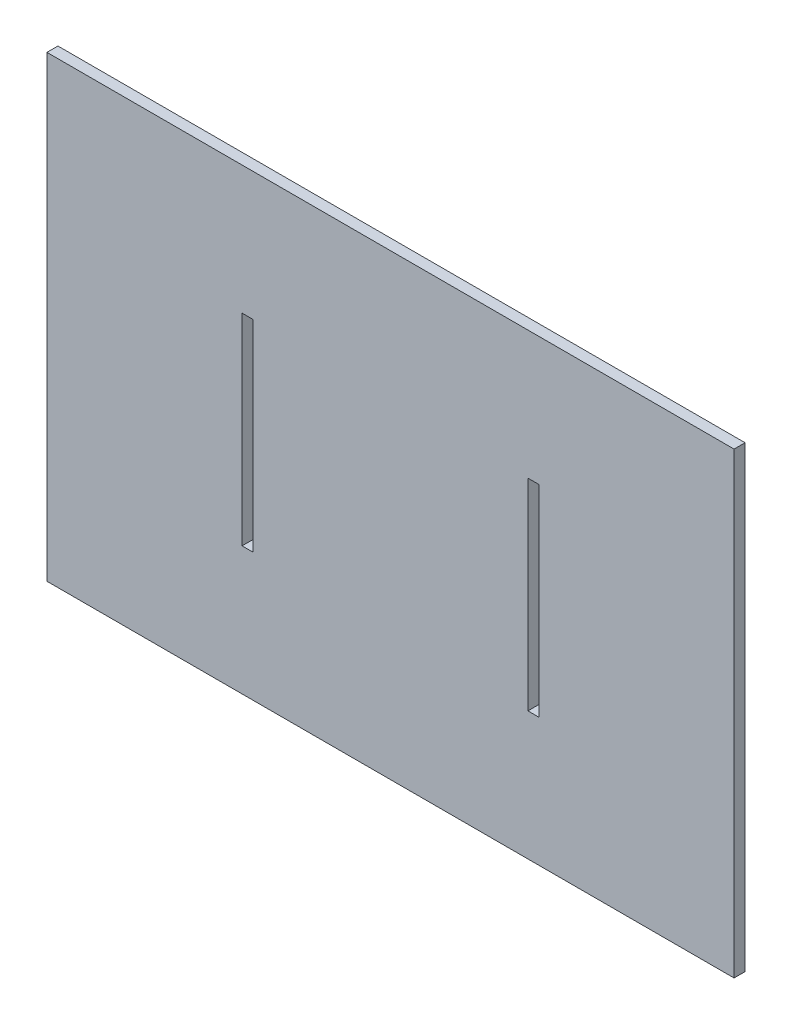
ISO-10303-21;
HEADER;
FILE_DESCRIPTION(('STEP AP214'),'2;1');
FILE_NAME('part.step','',(''),(''),'','','');
FILE_SCHEMA(('AUTOMOTIVE_DESIGN { 1 0 10303 214 1 1 1 1 }'));
ENDSEC;
DATA;
#1=APPLICATION_CONTEXT('core data for automotive mechanical design processes');
#2=APPLICATION_PROTOCOL_DEFINITION('international standard','automotive_design',2000,#1);
#3=PRODUCT_CONTEXT('',#1,'mechanical');
#4=PRODUCT('Part','Part','',(#3));
#5=PRODUCT_RELATED_PRODUCT_CATEGORY('part','',(#4));
#6=PRODUCT_DEFINITION_FORMATION('','',#4);
#7=PRODUCT_DEFINITION_CONTEXT('part definition',#1,'design');
#8=PRODUCT_DEFINITION('design','',#6,#7);
#9=PRODUCT_DEFINITION_SHAPE('','',#8);
#10=(LENGTH_UNIT() NAMED_UNIT(*) SI_UNIT(.MILLI.,.METRE.));
#11=(NAMED_UNIT(*) PLANE_ANGLE_UNIT() SI_UNIT($,.RADIAN.));
#12=(NAMED_UNIT(*) SI_UNIT($,.STERADIAN.) SOLID_ANGLE_UNIT());
#13=UNCERTAINTY_MEASURE_WITH_UNIT(LENGTH_MEASURE(1.E-05),#10,'distance_accuracy_value','');
#14=(GEOMETRIC_REPRESENTATION_CONTEXT(3) GLOBAL_UNCERTAINTY_ASSIGNED_CONTEXT((#13)) GLOBAL_UNIT_ASSIGNED_CONTEXT((#10,
#11,#12)) REPRESENTATION_CONTEXT('',''));
#15=CARTESIAN_POINT('',(0.,0.,0.));
#16=DIRECTION('',(0.,0.,1.));
#17=DIRECTION('',(1.,0.,0.));
#18=AXIS2_PLACEMENT_3D('',#15,#16,#17);
#19=CARTESIAN_POINT('',(0.,0.,12.));
#20=DIRECTION('',(1.,0.,0.));
#21=DIRECTION('',(0.,0.,-1.));
#22=AXIS2_PLACEMENT_3D('',#19,#20,#21);
#23=PLANE('',#22);
#24=DIRECTION('',(0.,-1.,0.));
#25=VECTOR('',#24,1.);
#26=CARTESIAN_POINT('',(0.,0.,0.));
#27=LINE('',#26,#25);
#28=CARTESIAN_POINT('',(0.,500.,0.));
#29=VERTEX_POINT('',#28);
#30=CARTESIAN_POINT('',(0.,0.,0.));
#31=VERTEX_POINT('',#30);
#32=EDGE_CURVE('E164',#29,#31,#27,.T.);
#33=ORIENTED_EDGE('',*,*,#32,.T.);
#34=DIRECTION('',(0.,0.,-1.));
#35=VECTOR('',#34,1.);
#36=CARTESIAN_POINT('',(0.,0.,12.));
#37=LINE('',#36,#35);
#38=CARTESIAN_POINT('',(0.,0.,12.));
#39=VERTEX_POINT('',#38);
#40=EDGE_CURVE('E197',#39,#31,#37,.T.);
#41=ORIENTED_EDGE('',*,*,#40,.F.);
#42=DIRECTION('',(0.,-1.,0.));
#43=VECTOR('',#42,1.);
#44=CARTESIAN_POINT('',(0.,0.,12.));
#45=LINE('',#44,#43);
#46=CARTESIAN_POINT('',(0.,500.,12.));
#47=VERTEX_POINT('',#46);
#48=EDGE_CURVE('E171',#47,#39,#45,.T.);
#49=ORIENTED_EDGE('',*,*,#48,.F.);
#50=DIRECTION('',(0.,0.,-1.));
#51=VECTOR('',#50,1.);
#52=CARTESIAN_POINT('',(0.,500.,12.));
#53=LINE('',#52,#51);
#54=EDGE_CURVE('E181',#47,#29,#53,.T.);
#55=ORIENTED_EDGE('',*,*,#54,.T.);
#56=EDGE_LOOP('',(#33,#41,#49,#55));
#57=FACE_BOUND('',#56,.T.);
#58=ADVANCED_FACE('F35',(#57),#23,.F.);
#59=CARTESIAN_POINT('',(0.,0.,12.));
#60=DIRECTION('',(0.,1.,0.));
#61=DIRECTION('',(0.,0.,1.));
#62=AXIS2_PLACEMENT_3D('',#59,#60,#61);
#63=PLANE('',#62);
#64=DIRECTION('',(1.,0.,0.));
#65=VECTOR('',#64,1.);
#66=CARTESIAN_POINT('',(0.,0.,0.));
#67=LINE('',#66,#65);
#68=CARTESIAN_POINT('',(750.,0.,0.));
#69=VERTEX_POINT('',#68);
#70=EDGE_CURVE('E184',#31,#69,#67,.T.);
#71=ORIENTED_EDGE('',*,*,#70,.T.);
#72=DIRECTION('',(0.,0.,-1.));
#73=VECTOR('',#72,1.);
#74=CARTESIAN_POINT('',(750.,0.,12.));
#75=LINE('',#74,#73);
#76=CARTESIAN_POINT('',(750.,0.,12.));
#77=VERTEX_POINT('',#76);
#78=EDGE_CURVE('E194',#77,#69,#75,.T.);
#79=ORIENTED_EDGE('',*,*,#78,.F.);
#80=DIRECTION('',(1.,0.,0.));
#81=VECTOR('',#80,1.);
#82=CARTESIAN_POINT('',(0.,0.,12.));
#83=LINE('',#82,#81);
#84=EDGE_CURVE('E174',#39,#77,#83,.T.);
#85=ORIENTED_EDGE('',*,*,#84,.F.);
#86=ORIENTED_EDGE('',*,*,#40,.T.);
#87=EDGE_LOOP('',(#71,#79,#85,#86));
#88=FACE_BOUND('',#87,.T.);
#89=ADVANCED_FACE('F234',(#88),#63,.F.);
#90=CARTESIAN_POINT('',(750.,0.,12.));
#91=DIRECTION('',(-1.,0.,0.));
#92=DIRECTION('',(0.,0.,1.));
#93=AXIS2_PLACEMENT_3D('',#90,#91,#92);
#94=PLANE('',#93);
#95=DIRECTION('',(0.,1.,0.));
#96=VECTOR('',#95,1.);
#97=CARTESIAN_POINT('',(750.,0.,0.));
#98=LINE('',#97,#96);
#99=CARTESIAN_POINT('',(750.,500.,0.));
#100=VERTEX_POINT('',#99);
#101=EDGE_CURVE('E186',#69,#100,#98,.T.);
#102=ORIENTED_EDGE('',*,*,#101,.T.);
#103=DIRECTION('',(0.,0.,-1.));
#104=VECTOR('',#103,1.);
#105=CARTESIAN_POINT('',(750.,500.,12.));
#106=LINE('',#105,#104);
#107=CARTESIAN_POINT('',(750.,500.,12.));
#108=VERTEX_POINT('',#107);
#109=EDGE_CURVE('E191',#108,#100,#106,.T.);
#110=ORIENTED_EDGE('',*,*,#109,.F.);
#111=DIRECTION('',(0.,1.,0.));
#112=VECTOR('',#111,1.);
#113=CARTESIAN_POINT('',(750.,0.,12.));
#114=LINE('',#113,#112);
#115=EDGE_CURVE('E177',#77,#108,#114,.T.);
#116=ORIENTED_EDGE('',*,*,#115,.F.);
#117=ORIENTED_EDGE('',*,*,#78,.T.);
#118=EDGE_LOOP('',(#102,#110,#116,#117));
#119=FACE_BOUND('',#118,.T.);
#120=ADVANCED_FACE('F239',(#119),#94,.F.);
#121=CARTESIAN_POINT('',(0.,500.,12.));
#122=DIRECTION('',(0.,-1.,0.));
#123=DIRECTION('',(0.,0.,-1.));
#124=AXIS2_PLACEMENT_3D('',#121,#122,#123);
#125=PLANE('',#124);
#126=DIRECTION('',(-1.,0.,0.));
#127=VECTOR('',#126,1.);
#128=CARTESIAN_POINT('',(0.,500.,0.));
#129=LINE('',#128,#127);
#130=EDGE_CURVE('E175',#100,#29,#129,.T.);
#131=ORIENTED_EDGE('',*,*,#130,.T.);
#132=ORIENTED_EDGE('',*,*,#54,.F.);
#133=DIRECTION('',(-1.,0.,0.));
#134=VECTOR('',#133,1.);
#135=CARTESIAN_POINT('',(0.,500.,12.));
#136=LINE('',#135,#134);
#137=EDGE_CURVE('E179',#108,#47,#136,.T.);
#138=ORIENTED_EDGE('',*,*,#137,.F.);
#139=ORIENTED_EDGE('',*,*,#109,.T.);
#140=EDGE_LOOP('',(#131,#132,#138,#139));
#141=FACE_BOUND('',#140,.T.);
#142=ADVANCED_FACE('F254',(#141),#125,.F.);
#143=CARTESIAN_POINT('',(0.,0.,12.));
#144=DIRECTION('',(0.,0.,-1.));
#145=DIRECTION('',(-1.,0.,0.));
#146=AXIS2_PLACEMENT_3D('',#143,#144,#145);
#147=PLANE('',#146);
#148=DIRECTION('',(1.,0.,0.));
#149=VECTOR('',#148,1.);
#150=CARTESIAN_POINT('',(525.,140.,12.));
#151=LINE('',#150,#149);
#152=CARTESIAN_POINT('',(525.,140.,12.));
#153=VERTEX_POINT('',#152);
#154=CARTESIAN_POINT('',(537.,140.,12.));
#155=VERTEX_POINT('',#154);
#156=EDGE_CURVE('E134',#153,#155,#151,.T.);
#157=ORIENTED_EDGE('',*,*,#156,.F.);
#158=DIRECTION('',(0.,-1.,0.));
#159=VECTOR('',#158,1.);
#160=CARTESIAN_POINT('',(525.,360.,12.));
#161=LINE('',#160,#159);
#162=CARTESIAN_POINT('',(525.,360.,12.));
#163=VERTEX_POINT('',#162);
#164=EDGE_CURVE('E49',#163,#153,#161,.T.);
#165=ORIENTED_EDGE('',*,*,#164,.F.);
#166=DIRECTION('',(-1.,0.,0.));
#167=VECTOR('',#166,1.);
#168=CARTESIAN_POINT('',(525.,360.,12.));
#169=LINE('',#168,#167);
#170=CARTESIAN_POINT('',(537.,360.,12.));
#171=VERTEX_POINT('',#170);
#172=EDGE_CURVE('E141',#171,#163,#169,.T.);
#173=ORIENTED_EDGE('',*,*,#172,.F.);
#174=DIRECTION('',(0.,1.,0.));
#175=VECTOR('',#174,1.);
#176=CARTESIAN_POINT('',(537.,360.,12.));
#177=LINE('',#176,#175);
#178=EDGE_CURVE('E125',#155,#171,#177,.T.);
#179=ORIENTED_EDGE('',*,*,#178,.F.);
#180=EDGE_LOOP('',(#157,#165,#173,#179));
#181=FACE_BOUND('',#180,.T.);
#182=DIRECTION('',(1.,0.,0.));
#183=VECTOR('',#182,1.);
#184=CARTESIAN_POINT('',(213.,140.,12.));
#185=LINE('',#184,#183);
#186=CARTESIAN_POINT('',(213.,140.,12.));
#187=VERTEX_POINT('',#186);
#188=CARTESIAN_POINT('',(225.,140.,12.));
#189=VERTEX_POINT('',#188);
#190=EDGE_CURVE('E152',#187,#189,#185,.T.);
#191=ORIENTED_EDGE('',*,*,#190,.F.);
#192=DIRECTION('',(0.,-1.,0.));
#193=VECTOR('',#192,1.);
#194=CARTESIAN_POINT('',(213.,360.,12.));
#195=LINE('',#194,#193);
#196=CARTESIAN_POINT('',(213.,360.,12.));
#197=VERTEX_POINT('',#196);
#198=EDGE_CURVE('E148',#197,#187,#195,.T.);
#199=ORIENTED_EDGE('',*,*,#198,.F.);
#200=DIRECTION('',(-1.,0.,0.));
#201=VECTOR('',#200,1.);
#202=CARTESIAN_POINT('',(213.,360.,12.));
#203=LINE('',#202,#201);
#204=CARTESIAN_POINT('',(225.,360.,12.));
#205=VERTEX_POINT('',#204);
#206=EDGE_CURVE('E158',#205,#197,#203,.T.);
#207=ORIENTED_EDGE('',*,*,#206,.F.);
#208=DIRECTION('',(0.,1.,0.));
#209=VECTOR('',#208,1.);
#210=CARTESIAN_POINT('',(225.,360.,12.));
#211=LINE('',#210,#209);
#212=EDGE_CURVE('E155',#189,#205,#211,.T.);
#213=ORIENTED_EDGE('',*,*,#212,.F.);
#214=EDGE_LOOP('',(#191,#199,#207,#213));
#215=FACE_BOUND('',#214,.T.);
#216=ORIENTED_EDGE('',*,*,#48,.T.);
#217=ORIENTED_EDGE('',*,*,#84,.T.);
#218=ORIENTED_EDGE('',*,*,#115,.T.);
#219=ORIENTED_EDGE('',*,*,#137,.T.);
#220=EDGE_LOOP('',(#216,#217,#218,#219));
#221=FACE_BOUND('',#220,.T.);
#222=ADVANCED_FACE('F138',(#181,#215,#221),#147,.F.);
#223=CARTESIAN_POINT('',(0.,0.,0.));
#224=DIRECTION('',(0.,0.,-1.));
#225=DIRECTION('',(-1.,0.,0.));
#226=AXIS2_PLACEMENT_3D('',#223,#224,#225);
#227=PLANE('',#226);
#228=DIRECTION('',(0.,1.,0.));
#229=VECTOR('',#228,1.);
#230=CARTESIAN_POINT('',(525.,0.,0.));
#231=LINE('',#230,#229);
#232=CARTESIAN_POINT('',(525.,140.,0.));
#233=VERTEX_POINT('',#232);
#234=CARTESIAN_POINT('',(525.,360.,0.));
#235=VERTEX_POINT('',#234);
#236=EDGE_CURVE('E11',#233,#235,#231,.T.);
#237=ORIENTED_EDGE('',*,*,#236,.F.);
#238=DIRECTION('',(-1.,0.,0.));
#239=VECTOR('',#238,1.);
#240=CARTESIAN_POINT('',(-1.29526019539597E-12,139.999999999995,0.));
#241=LINE('',#240,#239);
#242=CARTESIAN_POINT('',(537.,140.,0.));
#243=VERTEX_POINT('',#242);
#244=EDGE_CURVE('E209',#243,#233,#241,.T.);
#245=ORIENTED_EDGE('',*,*,#244,.F.);
#246=DIRECTION('',(0.,-1.,0.));
#247=VECTOR('',#246,1.);
#248=CARTESIAN_POINT('',(537.,-2.70995347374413E-13,0.));
#249=LINE('',#248,#247);
#250=CARTESIAN_POINT('',(537.,360.,0.));
#251=VERTEX_POINT('',#250);
#252=EDGE_CURVE('E128',#251,#243,#249,.T.);
#253=ORIENTED_EDGE('',*,*,#252,.F.);
#254=DIRECTION('',(1.,0.,0.));
#255=VECTOR('',#254,1.);
#256=CARTESIAN_POINT('',(-3.33066907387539E-12,359.999999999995,0.));
#257=LINE('',#256,#255);
#258=EDGE_CURVE('E42',#235,#251,#257,.T.);
#259=ORIENTED_EDGE('',*,*,#258,.F.);
#260=EDGE_LOOP('',(#237,#245,#253,#259));
#261=FACE_BOUND('',#260,.T.);
#262=DIRECTION('',(0.,1.,0.));
#263=VECTOR('',#262,1.);
#264=CARTESIAN_POINT('',(213.,0.,0.));
#265=LINE('',#264,#263);
#266=CARTESIAN_POINT('',(213.,140.,0.));
#267=VERTEX_POINT('',#266);
#268=CARTESIAN_POINT('',(213.,360.,0.));
#269=VERTEX_POINT('',#268);
#270=EDGE_CURVE('E207',#267,#269,#265,.T.);
#271=ORIENTED_EDGE('',*,*,#270,.F.);
#272=DIRECTION('',(-1.,0.,0.));
#273=VECTOR('',#272,1.);
#274=CARTESIAN_POINT('',(1.29526019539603E-12,140.000000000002,0.));
#275=LINE('',#274,#273);
#276=CARTESIAN_POINT('',(225.,140.,0.));
#277=VERTEX_POINT('',#276);
#278=EDGE_CURVE('E200',#277,#267,#275,.T.);
#279=ORIENTED_EDGE('',*,*,#278,.F.);
#280=DIRECTION('',(0.,-1.,0.));
#281=VECTOR('',#280,1.);
#282=CARTESIAN_POINT('',(225.,0.,0.));
#283=LINE('',#282,#281);
#284=CARTESIAN_POINT('',(225.,360.,0.));
#285=VERTEX_POINT('',#284);
#286=EDGE_CURVE('E202',#285,#277,#283,.T.);
#287=ORIENTED_EDGE('',*,*,#286,.F.);
#288=DIRECTION('',(1.,0.,0.));
#289=VECTOR('',#288,1.);
#290=CARTESIAN_POINT('',(3.33066907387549E-12,360.000000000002,0.));
#291=LINE('',#290,#289);
#292=EDGE_CURVE('E205',#269,#285,#291,.T.);
#293=ORIENTED_EDGE('',*,*,#292,.F.);
#294=EDGE_LOOP('',(#271,#279,#287,#293));
#295=FACE_BOUND('',#294,.T.);
#296=ORIENTED_EDGE('',*,*,#32,.F.);
#297=ORIENTED_EDGE('',*,*,#130,.F.);
#298=ORIENTED_EDGE('',*,*,#101,.F.);
#299=ORIENTED_EDGE('',*,*,#70,.F.);
#300=EDGE_LOOP('',(#296,#297,#298,#299));
#301=FACE_BOUND('',#300,.T.);
#302=ADVANCED_FACE('F217',(#261,#295,#301),#227,.T.);
#303=CARTESIAN_POINT('',(213.,360.,-2.));
#304=DIRECTION('',(-1.,0.,0.));
#305=DIRECTION('',(0.,-1.,0.));
#306=AXIS2_PLACEMENT_3D('',#303,#304,#305);
#307=PLANE('',#306);
#308=ORIENTED_EDGE('',*,*,#270,.T.);
#309=DIRECTION('',(0.,0.,1.));
#310=VECTOR('',#309,1.);
#311=CARTESIAN_POINT('',(213.,360.,-2.));
#312=LINE('',#311,#310);
#313=EDGE_CURVE('E162',#269,#197,#312,.T.);
#314=ORIENTED_EDGE('',*,*,#313,.T.);
#315=ORIENTED_EDGE('',*,*,#198,.T.);
#316=DIRECTION('',(0.,0.,1.));
#317=VECTOR('',#316,1.);
#318=CARTESIAN_POINT('',(213.,140.,-2.));
#319=LINE('',#318,#317);
#320=EDGE_CURVE('E161',#267,#187,#319,.T.);
#321=ORIENTED_EDGE('',*,*,#320,.F.);
#322=EDGE_LOOP('',(#308,#314,#315,#321));
#323=FACE_BOUND('',#322,.T.);
#324=ADVANCED_FACE('F265',(#323),#307,.F.);
#325=CARTESIAN_POINT('',(213.,360.,-2.));
#326=DIRECTION('',(0.,1.,0.));
#327=DIRECTION('',(-1.,0.,0.));
#328=AXIS2_PLACEMENT_3D('',#325,#326,#327);
#329=PLANE('',#328);
#330=ORIENTED_EDGE('',*,*,#292,.T.);
#331=DIRECTION('',(0.,0.,1.));
#332=VECTOR('',#331,1.);
#333=CARTESIAN_POINT('',(225.,360.,-2.));
#334=LINE('',#333,#332);
#335=EDGE_CURVE('E165',#285,#205,#334,.T.);
#336=ORIENTED_EDGE('',*,*,#335,.T.);
#337=ORIENTED_EDGE('',*,*,#206,.T.);
#338=ORIENTED_EDGE('',*,*,#313,.F.);
#339=EDGE_LOOP('',(#330,#336,#337,#338));
#340=FACE_BOUND('',#339,.T.);
#341=ADVANCED_FACE('F269',(#340),#329,.F.);
#342=CARTESIAN_POINT('',(225.,360.,-2.));
#343=DIRECTION('',(1.,0.,0.));
#344=DIRECTION('',(0.,1.,0.));
#345=AXIS2_PLACEMENT_3D('',#342,#343,#344);
#346=PLANE('',#345);
#347=ORIENTED_EDGE('',*,*,#286,.T.);
#348=DIRECTION('',(0.,0.,1.));
#349=VECTOR('',#348,1.);
#350=CARTESIAN_POINT('',(225.,140.,-2.));
#351=LINE('',#350,#349);
#352=EDGE_CURVE('E167',#277,#189,#351,.T.);
#353=ORIENTED_EDGE('',*,*,#352,.T.);
#354=ORIENTED_EDGE('',*,*,#212,.T.);
#355=ORIENTED_EDGE('',*,*,#335,.F.);
#356=EDGE_LOOP('',(#347,#353,#354,#355));
#357=FACE_BOUND('',#356,.T.);
#358=ADVANCED_FACE('F228',(#357),#346,.F.);
#359=CARTESIAN_POINT('',(213.,140.,-2.));
#360=DIRECTION('',(0.,-1.,0.));
#361=DIRECTION('',(1.,0.,0.));
#362=AXIS2_PLACEMENT_3D('',#359,#360,#361);
#363=PLANE('',#362);
#364=ORIENTED_EDGE('',*,*,#278,.T.);
#365=ORIENTED_EDGE('',*,*,#320,.T.);
#366=ORIENTED_EDGE('',*,*,#190,.T.);
#367=ORIENTED_EDGE('',*,*,#352,.F.);
#368=EDGE_LOOP('',(#364,#365,#366,#367));
#369=FACE_BOUND('',#368,.T.);
#370=ADVANCED_FACE('F221',(#369),#363,.F.);
#371=CARTESIAN_POINT('',(525.,360.,-2.));
#372=DIRECTION('',(-1.,0.,0.));
#373=DIRECTION('',(0.,0.,1.));
#374=AXIS2_PLACEMENT_3D('',#371,#372,#373);
#375=PLANE('',#374);
#376=ORIENTED_EDGE('',*,*,#236,.T.);
#377=DIRECTION('',(0.,0.,1.));
#378=VECTOR('',#377,1.);
#379=CARTESIAN_POINT('',(525.,360.,-2.));
#380=LINE('',#379,#378);
#381=EDGE_CURVE('E146',#235,#163,#380,.T.);
#382=ORIENTED_EDGE('',*,*,#381,.T.);
#383=ORIENTED_EDGE('',*,*,#164,.T.);
#384=DIRECTION('',(0.,0.,1.));
#385=VECTOR('',#384,1.);
#386=CARTESIAN_POINT('',(525.,140.,-2.));
#387=LINE('',#386,#385);
#388=EDGE_CURVE('E131',#233,#153,#387,.T.);
#389=ORIENTED_EDGE('',*,*,#388,.F.);
#390=EDGE_LOOP('',(#376,#382,#383,#389));
#391=FACE_BOUND('',#390,.T.);
#392=ADVANCED_FACE('F219',(#391),#375,.F.);
#393=CARTESIAN_POINT('',(525.,360.,-2.));
#394=DIRECTION('',(0.,1.,0.));
#395=DIRECTION('',(-1.,0.,0.));
#396=AXIS2_PLACEMENT_3D('',#393,#394,#395);
#397=PLANE('',#396);
#398=ORIENTED_EDGE('',*,*,#258,.T.);
#399=DIRECTION('',(0.,0.,1.));
#400=VECTOR('',#399,1.);
#401=CARTESIAN_POINT('',(537.,360.,-2.));
#402=LINE('',#401,#400);
#403=EDGE_CURVE('E130',#251,#171,#402,.T.);
#404=ORIENTED_EDGE('',*,*,#403,.T.);
#405=ORIENTED_EDGE('',*,*,#172,.T.);
#406=ORIENTED_EDGE('',*,*,#381,.F.);
#407=EDGE_LOOP('',(#398,#404,#405,#406));
#408=FACE_BOUND('',#407,.T.);
#409=ADVANCED_FACE('F214',(#408),#397,.F.);
#410=CARTESIAN_POINT('',(537.,360.,-2.));
#411=DIRECTION('',(1.,0.,0.));
#412=DIRECTION('',(0.,1.,0.));
#413=AXIS2_PLACEMENT_3D('',#410,#411,#412);
#414=PLANE('',#413);
#415=ORIENTED_EDGE('',*,*,#252,.T.);
#416=DIRECTION('',(0.,0.,1.));
#417=VECTOR('',#416,1.);
#418=CARTESIAN_POINT('',(537.,140.,-2.));
#419=LINE('',#418,#417);
#420=EDGE_CURVE('E57',#243,#155,#419,.T.);
#421=ORIENTED_EDGE('',*,*,#420,.T.);
#422=ORIENTED_EDGE('',*,*,#178,.T.);
#423=ORIENTED_EDGE('',*,*,#403,.F.);
#424=EDGE_LOOP('',(#415,#421,#422,#423));
#425=FACE_BOUND('',#424,.T.);
#426=ADVANCED_FACE('F122',(#425),#414,.F.);
#427=CARTESIAN_POINT('',(525.,140.,-2.));
#428=DIRECTION('',(0.,-1.,0.));
#429=DIRECTION('',(1.,0.,0.));
#430=AXIS2_PLACEMENT_3D('',#427,#428,#429);
#431=PLANE('',#430);
#432=ORIENTED_EDGE('',*,*,#244,.T.);
#433=ORIENTED_EDGE('',*,*,#388,.T.);
#434=ORIENTED_EDGE('',*,*,#156,.T.);
#435=ORIENTED_EDGE('',*,*,#420,.F.);
#436=EDGE_LOOP('',(#432,#433,#434,#435));
#437=FACE_BOUND('',#436,.T.);
#438=ADVANCED_FACE('F135',(#437),#431,.F.);
#439=CLOSED_SHELL('',(#58,#89,#120,#142,#222,#302,#324,#341,#358,#370,#392,#409,#426,#438));
#440=MANIFOLD_SOLID_BREP('B2',#439);
#441=ADVANCED_BREP_SHAPE_REPRESENTATION('',(#18,#440),#14);
#442=SHAPE_DEFINITION_REPRESENTATION(#9,#441);
ENDSEC;
END-ISO-10303-21;
